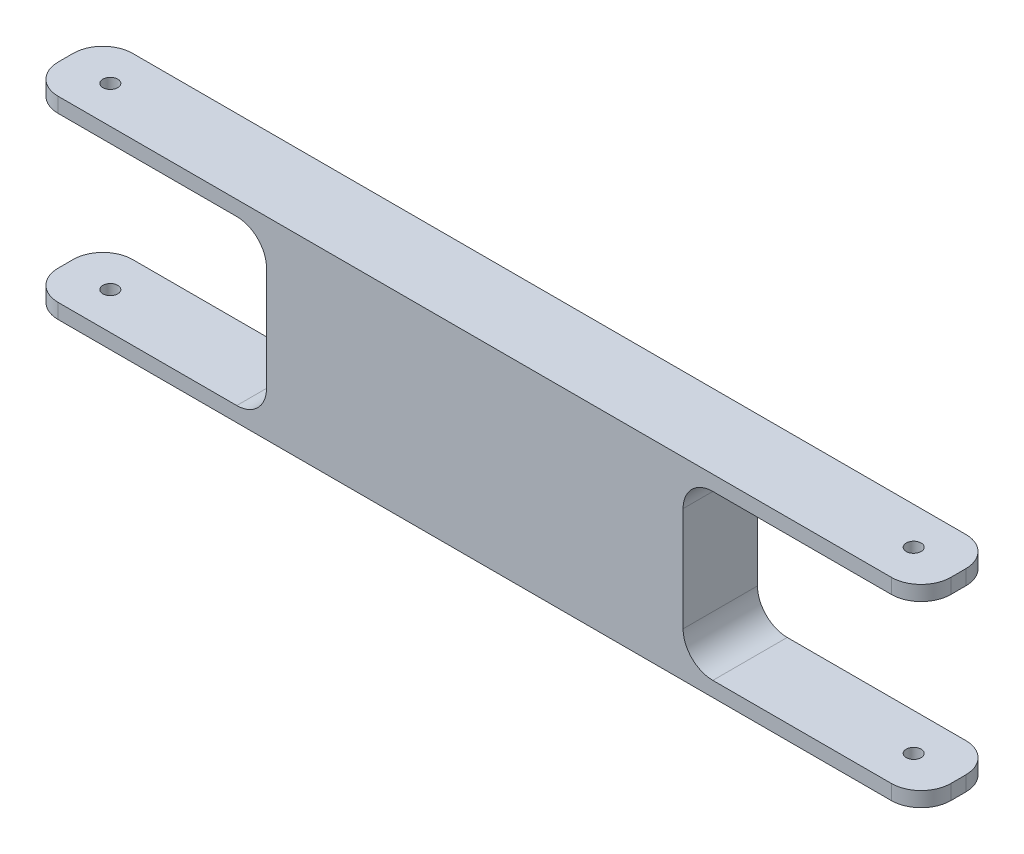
from build123d import *

# Parameters (mm, degrees)
SKETCH_1_W          = 300
SKETCH_1_H          = 65
EXTRUDE_1_DEPTH     = 25
SKETCH_2_W          = 80
SKETCH_2_H          = 55
CUT_EXTRUDE_1_DEPTH = 30
FILLET_1_R          = 10
FILLET_2_R          = 10
SKETCH_3_R          = 2.5
CUT_EXTRUDE_3_DEPTH = 166.378354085


with BuildPart() as part:
    # Sketch 1 → Extrude 1 (new body)
    with BuildSketch(Plane.XY):
        Rectangle(SKETCH_1_W, SKETCH_1_H)
    extrude(amount=EXTRUDE_1_DEPTH)

    # Sketch 2 → Cut-Extrude 1 (cut)
    with BuildSketch(Plane.XY.offset(25)):
        with Locations((110, 0)):
            Rectangle(SKETCH_2_W, SKETCH_2_H)
        with Locations((-110, 0)):
            Rectangle(SKETCH_2_W, SKETCH_2_H)
    extrude(amount=-CUT_EXTRUDE_1_DEPTH, mode=Mode.SUBTRACT)

    # Fillet 1
    fillet_1_edges = [part.edges().sort_by_distance(p)[0] for p in [
        (70, -27.5, 12.5),
        (70, 27.5, 12.5),
        (-70, 27.5, 12.5),
        (-70, -27.5, 12.5),
    ]]
    fillet(fillet_1_edges, radius=FILLET_1_R)

    # Fillet 2
    fillet_2_edges = [part.edges().sort_by_distance(p)[0] for p in [
        (150, -30, 25),
        (-150, -30, 0),
        (150, 30, 0),
        (-150, -30, 25),
        (150, 30, 25),
        (-150, 30, 25),
        (150, -30, 0),
        (-150, 30, 0),
    ]]
    fillet(fillet_2_edges, radius=FILLET_2_R)

    # Sketch 3 → Cut-Extrude 3 (cut, through all)
    with BuildSketch(Plane.XZ.offset(32.5)):
        with Locations((135, 12.5)):
            Circle(SKETCH_3_R)
        with Locations((-135, 12.5)):
            Circle(SKETCH_3_R)
    extrude(amount=-CUT_EXTRUDE_3_DEPTH, mode=Mode.SUBTRACT)


solid = part.part
